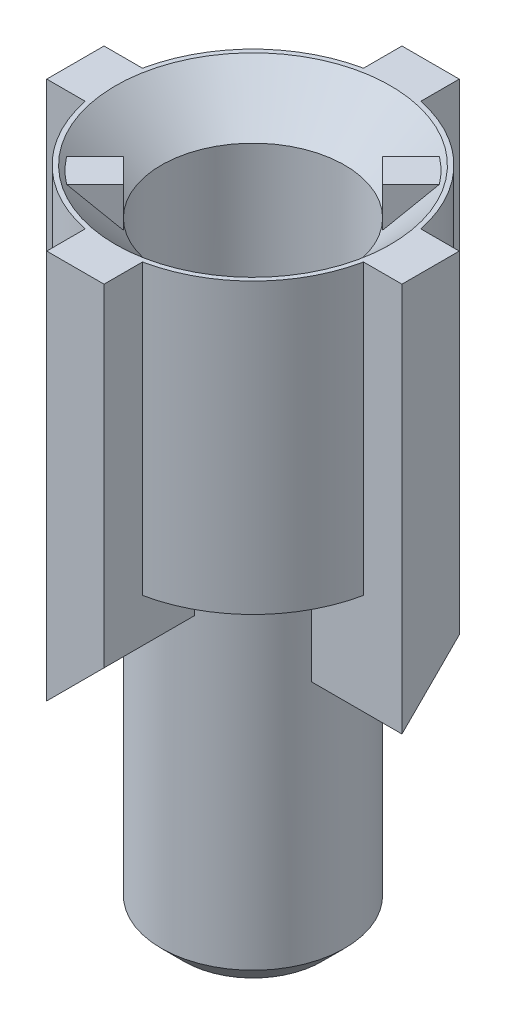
ISO-10303-21;
HEADER;
FILE_DESCRIPTION(('STEP AP214'),'2;1');
FILE_NAME('part.step','',(''),(''),'','','');
FILE_SCHEMA(('AUTOMOTIVE_DESIGN { 1 0 10303 214 1 1 1 1 }'));
ENDSEC;
DATA;
#1=APPLICATION_CONTEXT('core data for automotive mechanical design processes');
#2=APPLICATION_PROTOCOL_DEFINITION('international standard','automotive_design',2000,#1);
#3=PRODUCT_CONTEXT('',#1,'mechanical');
#4=PRODUCT('Part','Part','',(#3));
#5=PRODUCT_RELATED_PRODUCT_CATEGORY('part','',(#4));
#6=PRODUCT_DEFINITION_FORMATION('','',#4);
#7=PRODUCT_DEFINITION_CONTEXT('part definition',#1,'design');
#8=PRODUCT_DEFINITION('design','',#6,#7);
#9=PRODUCT_DEFINITION_SHAPE('','',#8);
#10=(LENGTH_UNIT() NAMED_UNIT(*) SI_UNIT(.MILLI.,.METRE.));
#11=(NAMED_UNIT(*) PLANE_ANGLE_UNIT() SI_UNIT($,.RADIAN.));
#12=(NAMED_UNIT(*) SI_UNIT($,.STERADIAN.) SOLID_ANGLE_UNIT());
#13=UNCERTAINTY_MEASURE_WITH_UNIT(LENGTH_MEASURE(1.E-05),#10,'distance_accuracy_value','');
#14=(GEOMETRIC_REPRESENTATION_CONTEXT(3) GLOBAL_UNCERTAINTY_ASSIGNED_CONTEXT((#13)) GLOBAL_UNIT_ASSIGNED_CONTEXT((#10,
#11,#12)) REPRESENTATION_CONTEXT('',''));
#15=CARTESIAN_POINT('',(0.,0.,0.));
#16=DIRECTION('',(0.,0.,1.));
#17=DIRECTION('',(1.,0.,0.));
#18=AXIS2_PLACEMENT_3D('',#15,#16,#17);
#19=CARTESIAN_POINT('',(0.,13.3,0.));
#20=DIRECTION('',(0.,1.,0.));
#21=DIRECTION('',(0.,0.,1.));
#22=AXIS2_PLACEMENT_3D('',#19,#20,#21);
#23=CONICAL_SURFACE('',#22,2.,0.78539816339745);
#24=CARTESIAN_POINT('',(0.,14.3,0.));
#25=DIRECTION('',(0.,1.,0.));
#26=DIRECTION('',(0.,0.,1.));
#27=AXIS2_PLACEMENT_3D('',#24,#25,#26);
#28=CIRCLE('',#27,3.);
#29=CARTESIAN_POINT('',(0.,14.3,3.));
#30=VERTEX_POINT('',#29);
#31=EDGE_CURVE('E335',#30,#30,#28,.F.);
#32=ORIENTED_EDGE('',*,*,#31,.F.);
#33=EDGE_LOOP('',(#32));
#34=FACE_BOUND('',#33,.T.);
#35=CARTESIAN_POINT('',(1.14884851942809,13.334904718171,-1.6795786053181));
#36=CARTESIAN_POINT('',(1.1841048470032,13.3256856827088,-1.64432227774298));
#37=CARTESIAN_POINT('',(1.219599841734,13.3182205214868,-1.60882728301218));
#38=CARTESIAN_POINT('',(1.29089390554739,13.306970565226,-1.5375332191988));
#39=CARTESIAN_POINT('',(1.32669309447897,13.3031872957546,-1.50173403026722));
#40=CARTESIAN_POINT('',(1.39791520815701,13.2995063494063,-1.43051191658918));
#41=CARTESIAN_POINT('',(1.43333679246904,13.2995575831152,-1.39509033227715));
#42=CARTESIAN_POINT('',(1.50406130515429,13.3034099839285,-1.32436581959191));
#43=CARTESIAN_POINT('',(1.53936428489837,13.3072092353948,-1.28906283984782));
#44=CARTESIAN_POINT('',(1.59208330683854,13.3156051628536,-1.23634381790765));
#45=CARTESIAN_POINT('',(1.60961243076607,13.3188520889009,-1.21881469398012));
#46=CARTESIAN_POINT('',(1.64463874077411,13.3262254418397,-1.18378838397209));
#47=CARTESIAN_POINT('',(1.66213561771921,13.3303548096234,-1.16629150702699));
#48=CARTESIAN_POINT('',(1.67957860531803,13.3349047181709,-1.14884851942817));
#49=B_SPLINE_CURVE_WITH_KNOTS('',3,(#35,#36,#37,#38,#39,#40,#41,#42,#43,#44,#45,#46,#47,#48),
.UNSPECIFIED.,.F.,.F.,(4,2,2,2,2,2,4),(0.,0.152104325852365,0.30427164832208,0.454411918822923,
0.604475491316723,0.679467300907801,0.75471304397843),.UNSPECIFIED.);
#50=CARTESIAN_POINT('',(1.14904851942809,13.3348525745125,-1.6793786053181));
#51=VERTEX_POINT('',#50);
#52=CARTESIAN_POINT('',(1.41421356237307,13.3,-1.41421356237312));
#53=VERTEX_POINT('',#52);
#54=EDGE_CURVE('E970',#51,#53,#49,.T.);
#55=ORIENTED_EDGE('',*,*,#54,.F.);
#56=CARTESIAN_POINT('',(1.76837067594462,14.2002,-2.29870076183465));
#57=CARTESIAN_POINT('',(1.71683620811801,14.1279324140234,-2.24716629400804));
#58=CARTESIAN_POINT('',(1.66528644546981,14.0556866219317,-2.19561653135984));
#59=CARTESIAN_POINT('',(1.56214565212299,13.9112541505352,-2.09247573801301));
#60=CARTESIAN_POINT('',(1.51055462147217,13.8390674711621,-2.04088470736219));
#61=CARTESIAN_POINT('',(1.40732046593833,13.6947685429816,-1.93765055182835));
#62=CARTESIAN_POINT('',(1.35567734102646,13.6226562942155,-1.88600742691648));
#63=CARTESIAN_POINT('',(1.25232048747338,13.4785329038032,-1.78265057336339));
#64=CARTESIAN_POINT('',(1.2006067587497,13.4065217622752,-1.73093684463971));
#65=CARTESIAN_POINT('',(1.14884851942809,13.3345745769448,-1.6791786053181));
#66=B_SPLINE_CURVE_WITH_KNOTS('',3,(#56,#57,#58,#59,#60,#61,#62,#63,#64,#65),.UNSPECIFIED.,.F.,
.F.,(4,2,2,2,4),(0.,0.307908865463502,0.615817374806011,0.923726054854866,1.23163509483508),.UNSPECIFIED.);
#67=CARTESIAN_POINT('',(1.76822805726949,14.2,-2.29855814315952));
#68=VERTEX_POINT('',#67);
#69=EDGE_CURVE('E262',#68,#51,#66,.T.);
#70=ORIENTED_EDGE('',*,*,#69,.F.);
#71=CARTESIAN_POINT('',(0.,14.2,0.));
#72=DIRECTION('',(0.,1.,0.));
#73=DIRECTION('',(0.,0.,1.));
#74=AXIS2_PLACEMENT_3D('',#71,#72,#73);
#75=CIRCLE('',#74,2.9);
#76=CARTESIAN_POINT('',(2.29855814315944,14.2,-1.7682280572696));
#77=VERTEX_POINT('',#76);
#78=EDGE_CURVE('E275',#68,#77,#75,.F.);
#79=ORIENTED_EDGE('',*,*,#78,.T.);
#80=CARTESIAN_POINT('',(1.67917860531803,13.3345745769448,-1.14884851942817));
#81=CARTESIAN_POINT('',(1.73093684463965,13.4065217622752,-1.20060675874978));
#82=CARTESIAN_POINT('',(1.78265057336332,13.4785329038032,-1.25232048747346));
#83=CARTESIAN_POINT('',(1.88600742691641,13.6226562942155,-1.35567734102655));
#84=CARTESIAN_POINT('',(1.93765055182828,13.6947685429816,-1.40732046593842));
#85=CARTESIAN_POINT('',(2.04088470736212,13.8390674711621,-1.51055462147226));
#86=CARTESIAN_POINT('',(2.09247573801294,13.9112541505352,-1.56214565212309));
#87=CARTESIAN_POINT('',(2.19561653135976,14.0556866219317,-1.66528644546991));
#88=CARTESIAN_POINT('',(2.24716629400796,14.1279324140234,-1.71683620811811));
#89=CARTESIAN_POINT('',(2.29870076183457,14.2002,-1.76837067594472));
#90=B_SPLINE_CURVE_WITH_KNOTS('',3,(#80,#81,#82,#83,#84,#85,#86,#87,#88,#89),.UNSPECIFIED.,.F.,
.F.,(4,2,2,2,4),(0.,0.307909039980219,0.615817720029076,0.923726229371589,1.23163509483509),.UNSPECIFIED.);
#91=CARTESIAN_POINT('',(1.67937860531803,13.3348525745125,-1.14904851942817));
#92=VERTEX_POINT('',#91);
#93=EDGE_CURVE('E278',#92,#77,#90,.T.);
#94=ORIENTED_EDGE('',*,*,#93,.F.);
#95=CARTESIAN_POINT('',(1.67957860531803,13.3349047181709,-1.14884851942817));
#96=CARTESIAN_POINT('',(1.64432227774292,13.3256856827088,-1.18410484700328));
#97=CARTESIAN_POINT('',(1.60882728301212,13.3182205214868,-1.21959984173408));
#98=CARTESIAN_POINT('',(1.53753321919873,13.306970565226,-1.29089390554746));
#99=CARTESIAN_POINT('',(1.50173403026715,13.3031872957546,-1.32669309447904));
#100=CARTESIAN_POINT('',(1.43051191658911,13.2995063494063,-1.39791520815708));
#101=CARTESIAN_POINT('',(1.39509033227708,13.2995575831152,-1.43333679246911));
#102=CARTESIAN_POINT('',(1.32436581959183,13.3034099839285,-1.50406130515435));
#103=CARTESIAN_POINT('',(1.28906283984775,13.3072092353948,-1.53936428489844));
#104=CARTESIAN_POINT('',(1.23634381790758,13.3156051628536,-1.59208330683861));
#105=CARTESIAN_POINT('',(1.21881469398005,13.3188520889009,-1.60961243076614));
#106=CARTESIAN_POINT('',(1.18378838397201,13.3262254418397,-1.64463874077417));
#107=CARTESIAN_POINT('',(1.16629150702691,13.3303548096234,-1.66213561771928));
#108=CARTESIAN_POINT('',(1.14884851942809,13.334904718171,-1.6795786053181));
#109=B_SPLINE_CURVE_WITH_KNOTS('',3,(#95,#96,#97,#98,#99,#100,#101,#102,#103,#104,#105,#106,
#107,#108),.UNSPECIFIED.,.F.,.F.,(4,2,2,2,2,2,4),(0.,0.152104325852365,0.304271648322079,
0.454411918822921,0.604475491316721,0.6794673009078,0.75471304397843),.UNSPECIFIED.);
#110=EDGE_CURVE('E12',#92,#53,#109,.T.);
#111=ORIENTED_EDGE('',*,*,#110,.T.);
#112=CARTESIAN_POINT('',(0.,13.3,0.));
#113=DIRECTION('',(0.,1.,0.));
#114=DIRECTION('',(0.,0.,1.));
#115=AXIS2_PLACEMENT_3D('',#112,#113,#114);
#116=CIRCLE('',#115,2.);
#117=CARTESIAN_POINT('',(-1.41421356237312,13.3,1.41421356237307));
#118=VERTEX_POINT('',#117);
#119=EDGE_CURVE('E338',#118,#53,#116,.T.);
#120=ORIENTED_EDGE('',*,*,#119,.F.);
#121=CARTESIAN_POINT('',(-1.14884851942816,13.3349047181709,1.67957860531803));
#122=CARTESIAN_POINT('',(-1.18410484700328,13.3256856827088,1.64432227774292));
#123=CARTESIAN_POINT('',(-1.21959984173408,13.3182205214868,1.60882728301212));
#124=CARTESIAN_POINT('',(-1.29089390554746,13.306970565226,1.53753321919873));
#125=CARTESIAN_POINT('',(-1.32669309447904,13.3031872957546,1.50173403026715));
#126=CARTESIAN_POINT('',(-1.39791520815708,13.2995063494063,1.43051191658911));
#127=CARTESIAN_POINT('',(-1.43333679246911,13.2995575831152,1.39509033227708));
#128=CARTESIAN_POINT('',(-1.50406130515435,13.3034099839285,1.32436581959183));
#129=CARTESIAN_POINT('',(-1.53936428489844,13.3072092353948,1.28906283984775));
#130=CARTESIAN_POINT('',(-1.59208330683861,13.3156051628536,1.23634381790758));
#131=CARTESIAN_POINT('',(-1.60961243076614,13.3188520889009,1.21881469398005));
#132=CARTESIAN_POINT('',(-1.64463874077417,13.3262254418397,1.18378838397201));
#133=CARTESIAN_POINT('',(-1.66213561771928,13.3303548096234,1.16629150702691));
#134=CARTESIAN_POINT('',(-1.6795786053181,13.334904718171,1.14884851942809));
#135=B_SPLINE_CURVE_WITH_KNOTS('',3,(#121,#122,#123,#124,#125,#126,#127,#128,#129,#130,#131,
#132,#133,#134),.UNSPECIFIED.,.F.,.F.,(4,2,2,2,2,2,4),(0.,0.152104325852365,0.304271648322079,
0.454411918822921,0.60447549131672,0.679467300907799,0.75471304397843),.UNSPECIFIED.);
#136=CARTESIAN_POINT('',(-1.14904851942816,13.3348525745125,1.67937860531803));
#137=VERTEX_POINT('',#136);
#138=EDGE_CURVE('E61',#137,#118,#135,.T.);
#139=ORIENTED_EDGE('',*,*,#138,.F.);
#140=CARTESIAN_POINT('',(-1.14884851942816,13.3345745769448,1.67917860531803));
#141=CARTESIAN_POINT('',(-1.20060675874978,13.4065217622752,1.73093684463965));
#142=CARTESIAN_POINT('',(-1.25232048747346,13.4785329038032,1.78265057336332));
#143=CARTESIAN_POINT('',(-1.35567734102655,13.6226562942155,1.88600742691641));
#144=CARTESIAN_POINT('',(-1.40732046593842,13.6947685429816,1.93765055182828));
#145=CARTESIAN_POINT('',(-1.51055462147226,13.8390674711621,2.04088470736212));
#146=CARTESIAN_POINT('',(-1.56214565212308,13.9112541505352,2.09247573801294));
#147=CARTESIAN_POINT('',(-1.66528644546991,14.0556866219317,2.19561653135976));
#148=CARTESIAN_POINT('',(-1.71683620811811,14.1279324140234,2.24716629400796));
#149=CARTESIAN_POINT('',(-1.76837067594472,14.2002,2.29870076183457));
#150=B_SPLINE_CURVE_WITH_KNOTS('',3,(#140,#141,#142,#143,#144,#145,#146,#147,#148,#149),
.UNSPECIFIED.,.F.,.F.,(4,2,2,2,4),(0.,0.30790903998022,0.615817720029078,0.92372622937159,
1.23163509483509),.UNSPECIFIED.);
#151=CARTESIAN_POINT('',(-1.76822805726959,14.2,2.29855814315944));
#152=VERTEX_POINT('',#151);
#153=EDGE_CURVE('E76',#137,#152,#150,.T.);
#154=ORIENTED_EDGE('',*,*,#153,.T.);
#155=CARTESIAN_POINT('',(0.,14.2,0.));
#156=DIRECTION('',(0.,1.,0.));
#157=DIRECTION('',(0.,0.,1.));
#158=AXIS2_PLACEMENT_3D('',#155,#156,#157);
#159=CIRCLE('',#158,2.9);
#160=CARTESIAN_POINT('',(-2.29855814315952,14.2,1.76822805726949));
#161=VERTEX_POINT('',#160);
#162=EDGE_CURVE('E319',#152,#161,#159,.F.);
#163=ORIENTED_EDGE('',*,*,#162,.T.);
#164=CARTESIAN_POINT('',(-2.29870076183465,14.2002,1.76837067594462));
#165=CARTESIAN_POINT('',(-2.24716629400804,14.1279324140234,1.71683620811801));
#166=CARTESIAN_POINT('',(-2.19561653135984,14.0556866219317,1.66528644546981));
#167=CARTESIAN_POINT('',(-2.09247573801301,13.9112541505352,1.56214565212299));
#168=CARTESIAN_POINT('',(-2.04088470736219,13.8390674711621,1.51055462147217));
#169=CARTESIAN_POINT('',(-1.93765055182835,13.6947685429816,1.40732046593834));
#170=CARTESIAN_POINT('',(-1.88600742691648,13.6226562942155,1.35567734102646));
#171=CARTESIAN_POINT('',(-1.78265057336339,13.4785329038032,1.25232048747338));
#172=CARTESIAN_POINT('',(-1.73093684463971,13.4065217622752,1.2006067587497));
#173=CARTESIAN_POINT('',(-1.6791786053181,13.3345745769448,1.14884851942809));
#174=B_SPLINE_CURVE_WITH_KNOTS('',3,(#164,#165,#166,#167,#168,#169,#170,#171,#172,#173),
.UNSPECIFIED.,.F.,.F.,(4,2,2,2,4),(0.,0.3079088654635,0.615817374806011,0.923726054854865,
1.23163509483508),.UNSPECIFIED.);
#175=CARTESIAN_POINT('',(-1.6793786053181,13.3348525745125,1.14904851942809));
#176=VERTEX_POINT('',#175);
#177=EDGE_CURVE('E314',#161,#176,#174,.T.);
#178=ORIENTED_EDGE('',*,*,#177,.T.);
#179=CARTESIAN_POINT('',(-1.6795786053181,13.334904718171,1.14884851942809));
#180=CARTESIAN_POINT('',(-1.64432227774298,13.3256856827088,1.1841048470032));
#181=CARTESIAN_POINT('',(-1.60882728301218,13.3182205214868,1.219599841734));
#182=CARTESIAN_POINT('',(-1.5375332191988,13.306970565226,1.29089390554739));
#183=CARTESIAN_POINT('',(-1.50173403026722,13.3031872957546,1.32669309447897));
#184=CARTESIAN_POINT('',(-1.43051191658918,13.2995063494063,1.39791520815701));
#185=CARTESIAN_POINT('',(-1.39509033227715,13.2995575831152,1.43333679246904));
#186=CARTESIAN_POINT('',(-1.32436581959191,13.3034099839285,1.50406130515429));
#187=CARTESIAN_POINT('',(-1.28906283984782,13.3072092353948,1.53936428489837));
#188=CARTESIAN_POINT('',(-1.23634381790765,13.3156051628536,1.59208330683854));
#189=CARTESIAN_POINT('',(-1.21881469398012,13.3188520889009,1.60961243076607));
#190=CARTESIAN_POINT('',(-1.18378838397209,13.3262254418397,1.64463874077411));
#191=CARTESIAN_POINT('',(-1.16629150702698,13.3303548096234,1.66213561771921));
#192=CARTESIAN_POINT('',(-1.14884851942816,13.3349047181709,1.67957860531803));
#193=B_SPLINE_CURVE_WITH_KNOTS('',3,(#179,#180,#181,#182,#183,#184,#185,#186,#187,#188,#189,
#190,#191,#192),.UNSPECIFIED.,.F.,.F.,(4,2,2,2,2,2,4),(0.,0.152104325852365,0.30427164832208,
0.454411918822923,0.604475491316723,0.679467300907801,0.75471304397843),.UNSPECIFIED.);
#194=EDGE_CURVE('E296',#176,#118,#193,.T.);
#195=ORIENTED_EDGE('',*,*,#194,.T.);
#196=EDGE_CURVE('E341',#53,#118,#116,.T.);
#197=ORIENTED_EDGE('',*,*,#196,.F.);
#198=EDGE_LOOP('',(#55,#70,#79,#94,#111,#120,#139,#154,#163,#178,#195,#197));
#199=FACE_BOUND('',#198,.T.);
#200=ADVANCED_FACE('F49',(#34,#199),#23,.F.);
#201=CARTESIAN_POINT('',(0.,8.4,0.));
#202=DIRECTION('',(0.,-1.,0.));
#203=DIRECTION('',(0.,0.,-1.));
#204=AXIS2_PLACEMENT_3D('',#201,#202,#203);
#205=CYLINDRICAL_SURFACE('',#204,2.);
#206=CARTESIAN_POINT('',(0.,0.500000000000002,0.));
#207=DIRECTION('',(0.,1.,0.));
#208=DIRECTION('',(0.,0.,1.));
#209=AXIS2_PLACEMENT_3D('',#206,#207,#208);
#210=CIRCLE('',#209,2.);
#211=CARTESIAN_POINT('',(0.,0.500000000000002,2.));
#212=VERTEX_POINT('',#211);
#213=EDGE_CURVE('E353',#212,#212,#210,.T.);
#214=ORIENTED_EDGE('',*,*,#213,.T.);
#215=EDGE_LOOP('',(#214));
#216=FACE_BOUND('',#215,.T.);
#217=DIRECTION('',(0.,-1.,0.));
#218=VECTOR('',#217,1.);
#219=CARTESIAN_POINT('',(-1.89983551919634,8.4,0.624999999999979));
#220=LINE('',#219,#218);
#221=CARTESIAN_POINT('',(-1.89983551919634,8.,0.624999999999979));
#222=VERTEX_POINT('',#221);
#223=CARTESIAN_POINT('',(-1.89983551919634,7.04999313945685,0.624999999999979));
#224=VERTEX_POINT('',#223);
#225=EDGE_CURVE('E515',#222,#224,#220,.T.);
#226=ORIENTED_EDGE('',*,*,#225,.T.);
#227=CARTESIAN_POINT('',(0.,6.42499313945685,0.));
#228=DIRECTION('',(0.,0.707106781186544,-0.707106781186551));
#229=DIRECTION('',(0.,-0.707106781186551,-0.707106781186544));
#230=AXIS2_PLACEMENT_3D('',#227,#228,#229);
#231=ELLIPSE('',#230,2.82842712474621,2.);
#232=CARTESIAN_POINT('',(-1.89983551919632,5.79999313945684,-0.625000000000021));
#233=VERTEX_POINT('',#232);
#234=EDGE_CURVE('E509',#224,#233,#231,.F.);
#235=ORIENTED_EDGE('',*,*,#234,.T.);
#236=DIRECTION('',(0.,-1.,0.));
#237=VECTOR('',#236,1.);
#238=CARTESIAN_POINT('',(-1.89983551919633,8.4,-0.62500000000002));
#239=LINE('',#238,#237);
#240=CARTESIAN_POINT('',(-1.89983551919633,8.,-0.62500000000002));
#241=VERTEX_POINT('',#240);
#242=EDGE_CURVE('E499',#233,#241,#239,.F.);
#243=ORIENTED_EDGE('',*,*,#242,.T.);
#244=CARTESIAN_POINT('',(0.,8.,0.));
#245=DIRECTION('',(0.,1.,0.));
#246=DIRECTION('',(0.,0.,1.));
#247=AXIS2_PLACEMENT_3D('',#244,#245,#246);
#248=CIRCLE('',#247,2.);
#249=CARTESIAN_POINT('',(-0.624999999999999,8.,-1.89983551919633));
#250=VERTEX_POINT('',#249);
#251=EDGE_CURVE('E345',#250,#241,#248,.T.);
#252=ORIENTED_EDGE('',*,*,#251,.F.);
#253=DIRECTION('',(0.,-1.,0.));
#254=VECTOR('',#253,1.);
#255=CARTESIAN_POINT('',(-0.624999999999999,8.4,-1.89983551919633));
#256=LINE('',#255,#254);
#257=CARTESIAN_POINT('',(-0.624999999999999,7.04999313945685,-1.89983551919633));
#258=VERTEX_POINT('',#257);
#259=EDGE_CURVE('E404',#250,#258,#256,.T.);
#260=ORIENTED_EDGE('',*,*,#259,.T.);
#261=CARTESIAN_POINT('',(0.,6.42499313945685,0.));
#262=DIRECTION('',(0.707106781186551,0.707106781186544,0.));
#263=DIRECTION('',(0.707106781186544,-0.707106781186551,0.));
#264=AXIS2_PLACEMENT_3D('',#261,#262,#263);
#265=ELLIPSE('',#264,2.8284271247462,2.);
#266=CARTESIAN_POINT('',(0.625000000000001,5.79999313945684,-1.89983551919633));
#267=VERTEX_POINT('',#266);
#268=EDGE_CURVE('E406',#258,#267,#265,.F.);
#269=ORIENTED_EDGE('',*,*,#268,.T.);
#270=DIRECTION('',(0.,-1.,0.));
#271=VECTOR('',#270,1.);
#272=CARTESIAN_POINT('',(0.625000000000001,8.4,-1.89983551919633));
#273=LINE('',#272,#271);
#274=CARTESIAN_POINT('',(0.625000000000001,8.,-1.89983551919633));
#275=VERTEX_POINT('',#274);
#276=EDGE_CURVE('E408',#267,#275,#273,.F.);
#277=ORIENTED_EDGE('',*,*,#276,.T.);
#278=CARTESIAN_POINT('',(1.89983551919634,8.,-0.624999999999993));
#279=VERTEX_POINT('',#278);
#280=EDGE_CURVE('E349',#279,#275,#248,.T.);
#281=ORIENTED_EDGE('',*,*,#280,.F.);
#282=DIRECTION('',(0.,-1.,0.));
#283=VECTOR('',#282,1.);
#284=CARTESIAN_POINT('',(1.89983551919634,8.4,-0.624999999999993));
#285=LINE('',#284,#283);
#286=CARTESIAN_POINT('',(1.89983551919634,7.04999313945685,-0.624999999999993));
#287=VERTEX_POINT('',#286);
#288=EDGE_CURVE('E443',#279,#287,#285,.T.);
#289=ORIENTED_EDGE('',*,*,#288,.T.);
#290=CARTESIAN_POINT('',(0.,6.42499313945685,0.));
#291=DIRECTION('',(0.,0.707106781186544,0.707106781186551));
#292=DIRECTION('',(0.,-0.707106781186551,0.707106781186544));
#293=AXIS2_PLACEMENT_3D('',#290,#291,#292);
#294=ELLIPSE('',#293,2.82842712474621,2.);
#295=CARTESIAN_POINT('',(1.89983551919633,5.79999313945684,0.625000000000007));
#296=VERTEX_POINT('',#295);
#297=EDGE_CURVE('E445',#287,#296,#294,.F.);
#298=ORIENTED_EDGE('',*,*,#297,.T.);
#299=DIRECTION('',(0.,-1.,0.));
#300=VECTOR('',#299,1.);
#301=CARTESIAN_POINT('',(1.89983551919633,8.4,0.625000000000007));
#302=LINE('',#301,#300);
#303=CARTESIAN_POINT('',(1.89983551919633,8.,0.625000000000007));
#304=VERTEX_POINT('',#303);
#305=EDGE_CURVE('E447',#296,#304,#302,.F.);
#306=ORIENTED_EDGE('',*,*,#305,.T.);
#307=CARTESIAN_POINT('',(0.624999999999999,8.,1.89983551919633));
#308=VERTEX_POINT('',#307);
#309=EDGE_CURVE('E658',#308,#304,#248,.T.);
#310=ORIENTED_EDGE('',*,*,#309,.F.);
#311=DIRECTION('',(0.,-1.,0.));
#312=VECTOR('',#311,1.);
#313=CARTESIAN_POINT('',(0.624999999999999,8.4,1.89983551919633));
#314=LINE('',#313,#312);
#315=CARTESIAN_POINT('',(0.624999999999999,7.04999313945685,1.89983551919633));
#316=VERTEX_POINT('',#315);
#317=EDGE_CURVE('E477',#308,#316,#314,.T.);
#318=ORIENTED_EDGE('',*,*,#317,.T.);
#319=CARTESIAN_POINT('',(0.,6.42499313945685,0.));
#320=DIRECTION('',(-0.707106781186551,0.707106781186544,0.));
#321=DIRECTION('',(-0.707106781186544,-0.707106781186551,0.));
#322=AXIS2_PLACEMENT_3D('',#319,#320,#321);
#323=ELLIPSE('',#322,2.82842712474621,2.);
#324=CARTESIAN_POINT('',(-0.625000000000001,5.79999313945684,1.89983551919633));
#325=VERTEX_POINT('',#324);
#326=EDGE_CURVE('E471',#316,#325,#323,.F.);
#327=ORIENTED_EDGE('',*,*,#326,.T.);
#328=DIRECTION('',(0.,-1.,0.));
#329=VECTOR('',#328,1.);
#330=CARTESIAN_POINT('',(-0.625000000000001,8.4,1.89983551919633));
#331=LINE('',#330,#329);
#332=CARTESIAN_POINT('',(-0.625000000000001,8.,1.89983551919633));
#333=VERTEX_POINT('',#332);
#334=EDGE_CURVE('E461',#325,#333,#331,.F.);
#335=ORIENTED_EDGE('',*,*,#334,.T.);
#336=EDGE_CURVE('E348',#222,#333,#248,.T.);
#337=ORIENTED_EDGE('',*,*,#336,.F.);
#338=EDGE_LOOP('',(#226,#235,#243,#252,#260,#269,#277,#281,#289,#298,#306,#310,#318,#327,#335,#337));
#339=FACE_BOUND('',#338,.T.);
#340=ADVANCED_FACE('F587',(#216,#339),#205,.T.);
#341=CARTESIAN_POINT('',(0.,8.,0.));
#342=DIRECTION('',(0.,1.,0.));
#343=DIRECTION('',(0.,0.,1.));
#344=AXIS2_PLACEMENT_3D('',#341,#342,#343);
#345=PLANE('',#344);
#346=DIRECTION('',(-1.,0.,0.));
#347=VECTOR('',#346,1.);
#348=CARTESIAN_POINT('',(0.,8.,0.624999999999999));
#349=LINE('',#348,#347);
#350=CARTESIAN_POINT('',(-3.03634237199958,8.,0.624999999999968));
#351=VERTEX_POINT('',#350);
#352=EDGE_CURVE('E480',#222,#351,#349,.T.);
#353=ORIENTED_EDGE('',*,*,#352,.F.);
#354=ORIENTED_EDGE('',*,*,#336,.T.);
#355=DIRECTION('',(0.,0.,-1.));
#356=VECTOR('',#355,1.);
#357=CARTESIAN_POINT('',(-0.625000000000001,8.,0.));
#358=LINE('',#357,#356);
#359=CARTESIAN_POINT('',(-0.625,8.,3.03634237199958));
#360=VERTEX_POINT('',#359);
#361=EDGE_CURVE('E455',#360,#333,#358,.T.);
#362=ORIENTED_EDGE('',*,*,#361,.F.);
#363=CARTESIAN_POINT('',(0.,8.,0.));
#364=DIRECTION('',(0.,1.,0.));
#365=DIRECTION('',(1.,0.,0.));
#366=AXIS2_PLACEMENT_3D('',#363,#364,#365);
#367=CIRCLE('',#366,3.1);
#368=EDGE_CURVE('E367',#351,#360,#367,.T.);
#369=ORIENTED_EDGE('',*,*,#368,.F.);
#370=EDGE_LOOP('',(#353,#354,#362,#369));
#371=FACE_BOUND('',#370,.T.);
#372=ADVANCED_FACE('F593',(#371),#345,.F.);
#373=DIRECTION('',(1.,0.,0.));
#374=VECTOR('',#373,1.);
#375=CARTESIAN_POINT('',(0.,8.,-0.625000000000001));
#376=LINE('',#375,#374);
#377=CARTESIAN_POINT('',(-3.03634237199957,8.,-0.625000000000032));
#378=VERTEX_POINT('',#377);
#379=EDGE_CURVE('E495',#378,#241,#376,.T.);
#380=ORIENTED_EDGE('',*,*,#379,.F.);
#381=CARTESIAN_POINT('',(-0.625,8.,-3.03634237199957));
#382=VERTEX_POINT('',#381);
#383=EDGE_CURVE('E363',#382,#378,#367,.T.);
#384=ORIENTED_EDGE('',*,*,#383,.F.);
#385=DIRECTION('',(0.,0.,-1.));
#386=VECTOR('',#385,1.);
#387=CARTESIAN_POINT('',(-0.624999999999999,8.,0.));
#388=LINE('',#387,#386);
#389=EDGE_CURVE('E378',#250,#382,#388,.T.);
#390=ORIENTED_EDGE('',*,*,#389,.F.);
#391=ORIENTED_EDGE('',*,*,#251,.T.);
#392=EDGE_LOOP('',(#380,#384,#390,#391));
#393=FACE_BOUND('',#392,.T.);
#394=ADVANCED_FACE('F611',(#393),#345,.F.);
#395=CARTESIAN_POINT('',(0.,14.3,0.));
#396=DIRECTION('',(0.,-1.,0.));
#397=DIRECTION('',(0.,0.,-1.));
#398=AXIS2_PLACEMENT_3D('',#395,#396,#397);
#399=CYLINDRICAL_SURFACE('',#398,3.1);
#400=DIRECTION('',(0.,-1.,0.));
#401=VECTOR('',#400,1.);
#402=CARTESIAN_POINT('',(-3.03634237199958,14.3,0.624999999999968));
#403=LINE('',#402,#401);
#404=CARTESIAN_POINT('',(-3.03634237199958,14.3,0.624999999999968));
#405=VERTEX_POINT('',#404);
#406=EDGE_CURVE('E492',#351,#405,#403,.F.);
#407=ORIENTED_EDGE('',*,*,#406,.F.);
#408=ORIENTED_EDGE('',*,*,#368,.T.);
#409=DIRECTION('',(0.,-1.,0.));
#410=VECTOR('',#409,1.);
#411=CARTESIAN_POINT('',(-0.625,14.3,3.03634237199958));
#412=LINE('',#411,#410);
#413=CARTESIAN_POINT('',(-0.625,14.3,3.03634237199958));
#414=VERTEX_POINT('',#413);
#415=EDGE_CURVE('E458',#414,#360,#412,.T.);
#416=ORIENTED_EDGE('',*,*,#415,.F.);
#417=CARTESIAN_POINT('',(0.,14.3,0.));
#418=DIRECTION('',(0.,1.,0.));
#419=DIRECTION('',(1.,0.,0.));
#420=AXIS2_PLACEMENT_3D('',#417,#418,#419);
#421=CIRCLE('',#420,3.1);
#422=EDGE_CURVE('E371',#405,#414,#421,.T.);
#423=ORIENTED_EDGE('',*,*,#422,.F.);
#424=EDGE_LOOP('',(#407,#408,#416,#423));
#425=FACE_BOUND('',#424,.T.);
#426=ADVANCED_FACE('F635',(#425),#399,.T.);
#427=DIRECTION('',(0.,-1.,0.));
#428=VECTOR('',#427,1.);
#429=CARTESIAN_POINT('',(-3.03634237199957,14.3,-0.625000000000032));
#430=LINE('',#429,#428);
#431=CARTESIAN_POINT('',(-3.03634237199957,14.3,-0.625000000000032));
#432=VERTEX_POINT('',#431);
#433=EDGE_CURVE('E497',#432,#378,#430,.T.);
#434=ORIENTED_EDGE('',*,*,#433,.F.);
#435=CARTESIAN_POINT('',(-0.625,14.3,-3.03634237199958));
#436=VERTEX_POINT('',#435);
#437=EDGE_CURVE('E362',#436,#432,#421,.T.);
#438=ORIENTED_EDGE('',*,*,#437,.F.);
#439=DIRECTION('',(0.,-1.,0.));
#440=VECTOR('',#439,1.);
#441=CARTESIAN_POINT('',(-0.625,14.3,-3.03634237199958));
#442=LINE('',#441,#440);
#443=EDGE_CURVE('E381',#382,#436,#442,.F.);
#444=ORIENTED_EDGE('',*,*,#443,.F.);
#445=ORIENTED_EDGE('',*,*,#383,.T.);
#446=EDGE_LOOP('',(#434,#438,#444,#445));
#447=FACE_BOUND('',#446,.T.);
#448=ADVANCED_FACE('F584',(#447),#399,.T.);
#449=DIRECTION('',(0.,0.,1.));
#450=VECTOR('',#449,1.);
#451=CARTESIAN_POINT('',(0.624999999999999,8.,0.));
#452=LINE('',#451,#450);
#453=CARTESIAN_POINT('',(0.625,8.,3.03634237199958));
#454=VERTEX_POINT('',#453);
#455=EDGE_CURVE('E450',#308,#454,#452,.T.);
#456=ORIENTED_EDGE('',*,*,#455,.F.);
#457=ORIENTED_EDGE('',*,*,#309,.T.);
#458=DIRECTION('',(-1.,0.,0.));
#459=VECTOR('',#458,1.);
#460=CARTESIAN_POINT('',(0.,8.,0.625000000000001));
#461=LINE('',#460,#459);
#462=CARTESIAN_POINT('',(3.03634237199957,8.,0.625000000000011));
#463=VERTEX_POINT('',#462);
#464=EDGE_CURVE('E411',#463,#304,#461,.T.);
#465=ORIENTED_EDGE('',*,*,#464,.F.);
#466=EDGE_CURVE('E684',#454,#463,#367,.T.);
#467=ORIENTED_EDGE('',*,*,#466,.F.);
#468=EDGE_LOOP('',(#456,#457,#465,#467));
#469=FACE_BOUND('',#468,.T.);
#470=ADVANCED_FACE('F701',(#469),#345,.F.);
#471=DIRECTION('',(0.,-1.,0.));
#472=VECTOR('',#471,1.);
#473=CARTESIAN_POINT('',(0.625,14.3,3.03634237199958));
#474=LINE('',#473,#472);
#475=CARTESIAN_POINT('',(0.625,14.3,3.03634237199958));
#476=VERTEX_POINT('',#475);
#477=EDGE_CURVE('E452',#454,#476,#474,.F.);
#478=ORIENTED_EDGE('',*,*,#477,.F.);
#479=ORIENTED_EDGE('',*,*,#466,.T.);
#480=DIRECTION('',(0.,-1.,0.));
#481=VECTOR('',#480,1.);
#482=CARTESIAN_POINT('',(3.03634237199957,14.3,0.625000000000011));
#483=LINE('',#482,#481);
#484=CARTESIAN_POINT('',(3.03634237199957,14.3,0.625000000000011));
#485=VERTEX_POINT('',#484);
#486=EDGE_CURVE('E414',#485,#463,#483,.T.);
#487=ORIENTED_EDGE('',*,*,#486,.F.);
#488=EDGE_CURVE('E636',#476,#485,#421,.T.);
#489=ORIENTED_EDGE('',*,*,#488,.F.);
#490=EDGE_LOOP('',(#478,#479,#487,#489));
#491=FACE_BOUND('',#490,.T.);
#492=ADVANCED_FACE('F583',(#491),#399,.T.);
#493=DIRECTION('',(1.,0.,0.));
#494=VECTOR('',#493,1.);
#495=CARTESIAN_POINT('',(0.,8.,-0.624999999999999));
#496=LINE('',#495,#494);
#497=CARTESIAN_POINT('',(3.03634237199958,8.,-0.624999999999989));
#498=VERTEX_POINT('',#497);
#499=EDGE_CURVE('E417',#279,#498,#496,.T.);
#500=ORIENTED_EDGE('',*,*,#499,.F.);
#501=ORIENTED_EDGE('',*,*,#280,.T.);
#502=DIRECTION('',(0.,0.,1.));
#503=VECTOR('',#502,1.);
#504=CARTESIAN_POINT('',(0.625000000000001,8.,0.));
#505=LINE('',#504,#503);
#506=CARTESIAN_POINT('',(0.625,8.,-3.03634237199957));
#507=VERTEX_POINT('',#506);
#508=EDGE_CURVE('E372',#507,#275,#505,.T.);
#509=ORIENTED_EDGE('',*,*,#508,.F.);
#510=EDGE_CURVE('E368',#498,#507,#367,.T.);
#511=ORIENTED_EDGE('',*,*,#510,.F.);
#512=EDGE_LOOP('',(#500,#501,#509,#511));
#513=FACE_BOUND('',#512,.T.);
#514=ADVANCED_FACE('F580',(#513),#345,.F.);
#515=DIRECTION('',(0.,-1.,0.));
#516=VECTOR('',#515,1.);
#517=CARTESIAN_POINT('',(3.03634237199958,14.3,-0.624999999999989));
#518=LINE('',#517,#516);
#519=CARTESIAN_POINT('',(3.03634237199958,14.3,-0.624999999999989));
#520=VERTEX_POINT('',#519);
#521=EDGE_CURVE('E420',#498,#520,#518,.F.);
#522=ORIENTED_EDGE('',*,*,#521,.F.);
#523=ORIENTED_EDGE('',*,*,#510,.T.);
#524=DIRECTION('',(0.,-1.,0.));
#525=VECTOR('',#524,1.);
#526=CARTESIAN_POINT('',(0.625,14.3,-3.03634237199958));
#527=LINE('',#526,#525);
#528=CARTESIAN_POINT('',(0.625,14.3,-3.03634237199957));
#529=VERTEX_POINT('',#528);
#530=EDGE_CURVE('E375',#529,#507,#527,.T.);
#531=ORIENTED_EDGE('',*,*,#530,.F.);
#532=EDGE_CURVE('E366',#520,#529,#421,.T.);
#533=ORIENTED_EDGE('',*,*,#532,.F.);
#534=EDGE_LOOP('',(#522,#523,#531,#533));
#535=FACE_BOUND('',#534,.T.);
#536=ADVANCED_FACE('F573',(#535),#399,.T.);
#537=CARTESIAN_POINT('',(0.,0.,0.));
#538=DIRECTION('',(0.,1.,0.));
#539=DIRECTION('',(0.,0.,1.));
#540=AXIS2_PLACEMENT_3D('',#537,#538,#539);
#541=PLANE('',#540);
#542=CARTESIAN_POINT('',(0.,0.,0.));
#543=DIRECTION('',(0.,1.,0.));
#544=DIRECTION('',(0.,0.,1.));
#545=AXIS2_PLACEMENT_3D('',#542,#543,#544);
#546=CIRCLE('',#545,1.5);
#547=CARTESIAN_POINT('',(0.,0.,1.5));
#548=VERTEX_POINT('',#547);
#549=EDGE_CURVE('E350',#548,#548,#546,.F.);
#550=ORIENTED_EDGE('',*,*,#549,.T.);
#551=EDGE_LOOP('',(#550));
#552=FACE_BOUND('',#551,.T.);
#553=CARTESIAN_POINT('',(0.,0.,0.));
#554=DIRECTION('',(0.,1.,0.));
#555=DIRECTION('',(0.,0.,1.));
#556=AXIS2_PLACEMENT_3D('',#553,#554,#555);
#557=CIRCLE('',#556,0.9);
#558=CARTESIAN_POINT('',(0.,0.,0.9));
#559=VERTEX_POINT('',#558);
#560=EDGE_CURVE('E356',#559,#559,#557,.T.);
#561=ORIENTED_EDGE('',*,*,#560,.T.);
#562=EDGE_LOOP('',(#561));
#563=FACE_BOUND('',#562,.T.);
#564=ADVANCED_FACE('F568',(#552,#563),#541,.F.);
#565=CARTESIAN_POINT('',(0.,8.4,0.));
#566=DIRECTION('',(0.,-1.,0.));
#567=DIRECTION('',(0.,0.,-1.));
#568=AXIS2_PLACEMENT_3D('',#565,#566,#567);
#569=CYLINDRICAL_SURFACE('',#568,0.9);
#570=CARTESIAN_POINT('',(0.,7.3,0.));
#571=DIRECTION('',(0.,1.,0.));
#572=DIRECTION('',(0.,0.,1.));
#573=AXIS2_PLACEMENT_3D('',#570,#571,#572);
#574=CIRCLE('',#573,0.9);
#575=CARTESIAN_POINT('',(0.,7.3,0.9));
#576=VERTEX_POINT('',#575);
#577=EDGE_CURVE('E342',#576,#576,#574,.T.);
#578=ORIENTED_EDGE('',*,*,#577,.T.);
#579=EDGE_LOOP('',(#578));
#580=FACE_BOUND('',#579,.T.);
#581=ORIENTED_EDGE('',*,*,#560,.F.);
#582=EDGE_LOOP('',(#581));
#583=FACE_BOUND('',#582,.T.);
#584=ADVANCED_FACE('F564',(#580,#583),#569,.F.);
#585=CARTESIAN_POINT('',(0.,0.500000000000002,0.));
#586=DIRECTION('',(0.,1.,0.));
#587=DIRECTION('',(0.,0.,1.));
#588=AXIS2_PLACEMENT_3D('',#585,#586,#587);
#589=CONICAL_SURFACE('',#588,2.,0.78539816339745);
#590=ORIENTED_EDGE('',*,*,#549,.F.);
#591=EDGE_LOOP('',(#590));
#592=FACE_BOUND('',#591,.T.);
#593=ORIENTED_EDGE('',*,*,#213,.F.);
#594=EDGE_LOOP('',(#593));
#595=FACE_BOUND('',#594,.T.);
#596=ADVANCED_FACE('F567',(#592,#595),#589,.T.);
#597=CARTESIAN_POINT('',(0.,14.3,0.));
#598=DIRECTION('',(0.,1.,0.));
#599=DIRECTION('',(0.,0.,1.));
#600=AXIS2_PLACEMENT_3D('',#597,#598,#599);
#601=PLANE('',#600);
#602=ORIENTED_EDGE('',*,*,#31,.T.);
#603=EDGE_LOOP('',(#602));
#604=FACE_BOUND('',#603,.T.);
#605=ORIENTED_EDGE('',*,*,#437,.T.);
#606=DIRECTION('',(-1.,0.,0.));
#607=VECTOR('',#606,1.);
#608=CARTESIAN_POINT('',(3.10100000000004,14.3,-0.624999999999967));
#609=LINE('',#608,#607);
#610=CARTESIAN_POINT('',(-3.87499999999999,14.3,-0.625000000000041));
#611=VERTEX_POINT('',#610);
#612=EDGE_CURVE('E500',#432,#611,#609,.T.);
#613=ORIENTED_EDGE('',*,*,#612,.T.);
#614=DIRECTION('',(0.,0.,1.));
#615=VECTOR('',#614,1.);
#616=CARTESIAN_POINT('',(-3.87500000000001,14.3,0.624999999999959));
#617=LINE('',#616,#615);
#618=CARTESIAN_POINT('',(-3.87500000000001,14.3,0.624999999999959));
#619=VERTEX_POINT('',#618);
#620=EDGE_CURVE('E502',#611,#619,#617,.T.);
#621=ORIENTED_EDGE('',*,*,#620,.T.);
#622=DIRECTION('',(-1.,0.,0.));
#623=VECTOR('',#622,1.);
#624=CARTESIAN_POINT('',(3.10100000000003,14.3,0.625000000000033));
#625=LINE('',#624,#623);
#626=EDGE_CURVE('E516',#405,#619,#625,.T.);
#627=ORIENTED_EDGE('',*,*,#626,.F.);
#628=ORIENTED_EDGE('',*,*,#422,.T.);
#629=DIRECTION('',(0.,0.,1.));
#630=VECTOR('',#629,1.);
#631=CARTESIAN_POINT('',(-0.625,14.3,-3.876));
#632=LINE('',#631,#630);
#633=CARTESIAN_POINT('',(-0.625,14.3,3.875));
#634=VERTEX_POINT('',#633);
#635=EDGE_CURVE('E462',#414,#634,#632,.T.);
#636=ORIENTED_EDGE('',*,*,#635,.T.);
#637=DIRECTION('',(1.,0.,0.));
#638=VECTOR('',#637,1.);
#639=CARTESIAN_POINT('',(0.625,14.3,3.875));
#640=LINE('',#639,#638);
#641=CARTESIAN_POINT('',(0.625,14.3,3.875));
#642=VERTEX_POINT('',#641);
#643=EDGE_CURVE('E464',#634,#642,#640,.T.);
#644=ORIENTED_EDGE('',*,*,#643,.T.);
#645=DIRECTION('',(0.,0.,1.));
#646=VECTOR('',#645,1.);
#647=CARTESIAN_POINT('',(0.625,14.3,-3.876));
#648=LINE('',#647,#646);
#649=EDGE_CURVE('E478',#476,#642,#648,.T.);
#650=ORIENTED_EDGE('',*,*,#649,.F.);
#651=ORIENTED_EDGE('',*,*,#488,.T.);
#652=DIRECTION('',(1.,0.,0.));
#653=VECTOR('',#652,1.);
#654=CARTESIAN_POINT('',(-3.10100000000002,14.3,0.624999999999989));
#655=LINE('',#654,#653);
#656=CARTESIAN_POINT('',(3.875,14.3,0.625000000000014));
#657=VERTEX_POINT('',#656);
#658=EDGE_CURVE('E427',#485,#657,#655,.T.);
#659=ORIENTED_EDGE('',*,*,#658,.T.);
#660=DIRECTION('',(0.,0.,-1.));
#661=VECTOR('',#660,1.);
#662=CARTESIAN_POINT('',(3.875,14.3,-0.624999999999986));
#663=LINE('',#662,#661);
#664=CARTESIAN_POINT('',(3.875,14.3,-0.624999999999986));
#665=VERTEX_POINT('',#664);
#666=EDGE_CURVE('E431',#657,#665,#663,.T.);
#667=ORIENTED_EDGE('',*,*,#666,.T.);
#668=DIRECTION('',(1.,0.,0.));
#669=VECTOR('',#668,1.);
#670=CARTESIAN_POINT('',(-3.10100000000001,14.3,-0.625000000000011));
#671=LINE('',#670,#669);
#672=EDGE_CURVE('E429',#520,#665,#671,.T.);
#673=ORIENTED_EDGE('',*,*,#672,.F.);
#674=ORIENTED_EDGE('',*,*,#532,.T.);
#675=DIRECTION('',(0.,0.,-1.));
#676=VECTOR('',#675,1.);
#677=CARTESIAN_POINT('',(0.625,14.3,3.101));
#678=LINE('',#677,#676);
#679=CARTESIAN_POINT('',(0.625,14.3,-3.875));
#680=VERTEX_POINT('',#679);
#681=EDGE_CURVE('E388',#529,#680,#678,.T.);
#682=ORIENTED_EDGE('',*,*,#681,.T.);
#683=DIRECTION('',(-1.,0.,0.));
#684=VECTOR('',#683,1.);
#685=CARTESIAN_POINT('',(-0.625,14.3,-3.875));
#686=LINE('',#685,#684);
#687=CARTESIAN_POINT('',(-0.625,14.3,-3.875));
#688=VERTEX_POINT('',#687);
#689=EDGE_CURVE('E392',#680,#688,#686,.T.);
#690=ORIENTED_EDGE('',*,*,#689,.T.);
#691=DIRECTION('',(0.,0.,-1.));
#692=VECTOR('',#691,1.);
#693=CARTESIAN_POINT('',(-0.625,14.3,3.101));
#694=LINE('',#693,#692);
#695=EDGE_CURVE('E390',#436,#688,#694,.T.);
#696=ORIENTED_EDGE('',*,*,#695,.F.);
#697=EDGE_LOOP('',(#605,#613,#621,#627,#628,#636,#644,#650,#651,#659,#667,#673,#674,#682,#690,#696));
#698=FACE_BOUND('',#697,.T.);
#699=ADVANCED_FACE('F555',(#604,#698),#601,.T.);
#700=CARTESIAN_POINT('',(0.,14.3,0.));
#701=DIRECTION('',(0.,-1.,0.));
#702=DIRECTION('',(0.,0.,-1.));
#703=AXIS2_PLACEMENT_3D('',#700,#701,#702);
#704=CYLINDRICAL_SURFACE('',#703,2.);
#705=ORIENTED_EDGE('',*,*,#119,.T.);
#706=ORIENTED_EDGE('',*,*,#196,.T.);
#707=EDGE_LOOP('',(#705,#706));
#708=FACE_BOUND('',#707,.T.);
#709=CARTESIAN_POINT('',(0.,8.4,0.));
#710=DIRECTION('',(0.,1.,0.));
#711=DIRECTION('',(0.,0.,1.));
#712=AXIS2_PLACEMENT_3D('',#709,#710,#711);
#713=CIRCLE('',#712,2.);
#714=CARTESIAN_POINT('',(0.,8.4,2.));
#715=VERTEX_POINT('',#714);
#716=EDGE_CURVE('E359',#715,#715,#713,.F.);
#717=ORIENTED_EDGE('',*,*,#716,.T.);
#718=EDGE_LOOP('',(#717));
#719=FACE_BOUND('',#718,.T.);
#720=ADVANCED_FACE('F551',(#708,#719),#704,.F.);
#721=CARTESIAN_POINT('',(0.,7.3,0.));
#722=DIRECTION('',(0.,1.,0.));
#723=DIRECTION('',(0.,0.,1.));
#724=AXIS2_PLACEMENT_3D('',#721,#722,#723);
#725=CONICAL_SURFACE('',#724,0.9,0.78539816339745);
#726=ORIENTED_EDGE('',*,*,#716,.F.);
#727=EDGE_LOOP('',(#726));
#728=FACE_BOUND('',#727,.T.);
#729=ORIENTED_EDGE('',*,*,#577,.F.);
#730=EDGE_LOOP('',(#729));
#731=FACE_BOUND('',#730,.T.);
#732=ADVANCED_FACE('F554',(#728,#731),#725,.F.);
#733=CARTESIAN_POINT('',(0.625,14.3,3.101));
#734=DIRECTION('',(-1.,0.,0.));
#735=DIRECTION('',(0.,-1.,0.));
#736=AXIS2_PLACEMENT_3D('',#733,#734,#735);
#737=PLANE('',#736);
#738=ORIENTED_EDGE('',*,*,#530,.T.);
#739=ORIENTED_EDGE('',*,*,#508,.T.);
#740=ORIENTED_EDGE('',*,*,#276,.F.);
#741=DIRECTION('',(0.,0.,-1.));
#742=VECTOR('',#741,1.);
#743=CARTESIAN_POINT('',(0.625000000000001,5.79999313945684,3.101));
#744=LINE('',#743,#742);
#745=CARTESIAN_POINT('',(0.625000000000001,5.79999313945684,-3.875));
#746=VERTEX_POINT('',#745);
#747=EDGE_CURVE('E386',#267,#746,#744,.T.);
#748=ORIENTED_EDGE('',*,*,#747,.T.);
#749=DIRECTION('',(0.,1.,0.));
#750=VECTOR('',#749,1.);
#751=CARTESIAN_POINT('',(0.625,14.3,-3.875));
#752=LINE('',#751,#750);
#753=EDGE_CURVE('E395',#746,#680,#752,.T.);
#754=ORIENTED_EDGE('',*,*,#753,.T.);
#755=ORIENTED_EDGE('',*,*,#681,.F.);
#756=EDGE_LOOP('',(#738,#739,#740,#748,#754,#755));
#757=FACE_BOUND('',#756,.T.);
#758=ADVANCED_FACE('F561',(#757),#737,.F.);
#759=CARTESIAN_POINT('',(-0.625,14.3,3.101));
#760=DIRECTION('',(1.,0.,0.));
#761=DIRECTION('',(0.,1.,0.));
#762=AXIS2_PLACEMENT_3D('',#759,#760,#761);
#763=PLANE('',#762);
#764=ORIENTED_EDGE('',*,*,#259,.F.);
#765=ORIENTED_EDGE('',*,*,#389,.T.);
#766=ORIENTED_EDGE('',*,*,#443,.T.);
#767=ORIENTED_EDGE('',*,*,#695,.T.);
#768=DIRECTION('',(0.,-1.,0.));
#769=VECTOR('',#768,1.);
#770=CARTESIAN_POINT('',(-0.625,14.3,-3.875));
#771=LINE('',#770,#769);
#772=CARTESIAN_POINT('',(-0.624999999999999,7.04999313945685,-3.875));
#773=VERTEX_POINT('',#772);
#774=EDGE_CURVE('E401',#688,#773,#771,.T.);
#775=ORIENTED_EDGE('',*,*,#774,.T.);
#776=DIRECTION('',(0.,0.,-1.));
#777=VECTOR('',#776,1.);
#778=CARTESIAN_POINT('',(-0.624999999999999,7.04999313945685,3.101));
#779=LINE('',#778,#777);
#780=EDGE_CURVE('E384',#258,#773,#779,.T.);
#781=ORIENTED_EDGE('',*,*,#780,.F.);
#782=EDGE_LOOP('',(#764,#765,#766,#767,#775,#781));
#783=FACE_BOUND('',#782,.T.);
#784=ADVANCED_FACE('F606',(#783),#763,.F.);
#785=CARTESIAN_POINT('',(0.,0.,-3.875));
#786=DIRECTION('',(0.,0.,1.));
#787=DIRECTION('',(1.,0.,0.));
#788=AXIS2_PLACEMENT_3D('',#785,#786,#787);
#789=PLANE('',#788);
#790=ORIENTED_EDGE('',*,*,#774,.F.);
#791=ORIENTED_EDGE('',*,*,#689,.F.);
#792=ORIENTED_EDGE('',*,*,#753,.F.);
#793=DIRECTION('',(0.707106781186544,-0.707106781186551,0.));
#794=VECTOR('',#793,1.);
#795=CARTESIAN_POINT('',(0.625000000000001,5.79999313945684,-3.875));
#796=LINE('',#795,#794);
#797=EDGE_CURVE('E398',#773,#746,#796,.T.);
#798=ORIENTED_EDGE('',*,*,#797,.F.);
#799=EDGE_LOOP('',(#790,#791,#792,#798));
#800=FACE_BOUND('',#799,.T.);
#801=ADVANCED_FACE('F652',(#800),#789,.F.);
#802=CARTESIAN_POINT('',(0.625000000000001,5.79999313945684,3.101));
#803=DIRECTION('',(0.707106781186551,0.707106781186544,0.));
#804=DIRECTION('',(-0.707106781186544,0.707106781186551,0.));
#805=AXIS2_PLACEMENT_3D('',#802,#803,#804);
#806=PLANE('',#805);
#807=ORIENTED_EDGE('',*,*,#268,.F.);
#808=ORIENTED_EDGE('',*,*,#780,.T.);
#809=ORIENTED_EDGE('',*,*,#797,.T.);
#810=ORIENTED_EDGE('',*,*,#747,.F.);
#811=EDGE_LOOP('',(#807,#808,#809,#810));
#812=FACE_BOUND('',#811,.T.);
#813=ADVANCED_FACE('F654',(#812),#806,.F.);
#814=CARTESIAN_POINT('',(-3.10100000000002,14.3,0.624999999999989));
#815=DIRECTION('',(0.,0.,-1.));
#816=DIRECTION('',(-1.,0.,0.));
#817=AXIS2_PLACEMENT_3D('',#814,#815,#816);
#818=PLANE('',#817);
#819=ORIENTED_EDGE('',*,*,#486,.T.);
#820=ORIENTED_EDGE('',*,*,#464,.T.);
#821=ORIENTED_EDGE('',*,*,#305,.F.);
#822=DIRECTION('',(1.,0.,0.));
#823=VECTOR('',#822,1.);
#824=CARTESIAN_POINT('',(-3.10100000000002,5.79999313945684,0.62499999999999));
#825=LINE('',#824,#823);
#826=CARTESIAN_POINT('',(3.875,5.79999313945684,0.625000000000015));
#827=VERTEX_POINT('',#826);
#828=EDGE_CURVE('E425',#296,#827,#825,.T.);
#829=ORIENTED_EDGE('',*,*,#828,.T.);
#830=DIRECTION('',(0.,1.,0.));
#831=VECTOR('',#830,1.);
#832=CARTESIAN_POINT('',(3.875,14.3,0.625000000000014));
#833=LINE('',#832,#831);
#834=EDGE_CURVE('E434',#827,#657,#833,.T.);
#835=ORIENTED_EDGE('',*,*,#834,.T.);
#836=ORIENTED_EDGE('',*,*,#658,.F.);
#837=EDGE_LOOP('',(#819,#820,#821,#829,#835,#836));
#838=FACE_BOUND('',#837,.T.);
#839=ADVANCED_FACE('F686',(#838),#818,.F.);
#840=CARTESIAN_POINT('',(-3.10100000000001,14.3,-0.625000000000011));
#841=DIRECTION('',(0.,0.,1.));
#842=DIRECTION('',(1.,0.,0.));
#843=AXIS2_PLACEMENT_3D('',#840,#841,#842);
#844=PLANE('',#843);
#845=ORIENTED_EDGE('',*,*,#288,.F.);
#846=ORIENTED_EDGE('',*,*,#499,.T.);
#847=ORIENTED_EDGE('',*,*,#521,.T.);
#848=ORIENTED_EDGE('',*,*,#672,.T.);
#849=DIRECTION('',(0.,-1.,0.));
#850=VECTOR('',#849,1.);
#851=CARTESIAN_POINT('',(3.875,14.3,-0.624999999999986));
#852=LINE('',#851,#850);
#853=CARTESIAN_POINT('',(3.875,7.04999313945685,-0.624999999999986));
#854=VERTEX_POINT('',#853);
#855=EDGE_CURVE('E440',#665,#854,#852,.T.);
#856=ORIENTED_EDGE('',*,*,#855,.T.);
#857=DIRECTION('',(1.,0.,0.));
#858=VECTOR('',#857,1.);
#859=CARTESIAN_POINT('',(-3.10100000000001,7.04999313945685,-0.62500000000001));
#860=LINE('',#859,#858);
#861=EDGE_CURVE('E423',#287,#854,#860,.T.);
#862=ORIENTED_EDGE('',*,*,#861,.F.);
#863=EDGE_LOOP('',(#845,#846,#847,#848,#856,#862));
#864=FACE_BOUND('',#863,.T.);
#865=ADVANCED_FACE('F695',(#864),#844,.F.);
#866=CARTESIAN_POINT('',(3.875,0.,0.));
#867=DIRECTION('',(-1.,0.,0.));
#868=DIRECTION('',(0.,0.,1.));
#869=AXIS2_PLACEMENT_3D('',#866,#867,#868);
#870=PLANE('',#869);
#871=ORIENTED_EDGE('',*,*,#855,.F.);
#872=ORIENTED_EDGE('',*,*,#666,.F.);
#873=ORIENTED_EDGE('',*,*,#834,.F.);
#874=DIRECTION('',(0.,-0.707106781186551,0.707106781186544));
#875=VECTOR('',#874,1.);
#876=CARTESIAN_POINT('',(3.875,5.79999313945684,0.625000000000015));
#877=LINE('',#876,#875);
#878=EDGE_CURVE('E437',#854,#827,#877,.T.);
#879=ORIENTED_EDGE('',*,*,#878,.F.);
#880=EDGE_LOOP('',(#871,#872,#873,#879));
#881=FACE_BOUND('',#880,.T.);
#882=ADVANCED_FACE('F692',(#881),#870,.F.);
#883=CARTESIAN_POINT('',(-3.10100000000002,5.79999313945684,0.62499999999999));
#884=DIRECTION('',(0.,0.707106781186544,0.707106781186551));
#885=DIRECTION('',(0.,-0.707106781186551,0.707106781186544));
#886=AXIS2_PLACEMENT_3D('',#883,#884,#885);
#887=PLANE('',#886);
#888=ORIENTED_EDGE('',*,*,#297,.F.);
#889=ORIENTED_EDGE('',*,*,#861,.T.);
#890=ORIENTED_EDGE('',*,*,#878,.T.);
#891=ORIENTED_EDGE('',*,*,#828,.F.);
#892=EDGE_LOOP('',(#888,#889,#890,#891));
#893=FACE_BOUND('',#892,.T.);
#894=ADVANCED_FACE('F700',(#893),#887,.F.);
#895=CARTESIAN_POINT('',(0.625,14.3,-3.876));
#896=DIRECTION('',(-1.,0.,0.));
#897=DIRECTION('',(0.,-1.,0.));
#898=AXIS2_PLACEMENT_3D('',#895,#896,#897);
#899=PLANE('',#898);
#900=ORIENTED_EDGE('',*,*,#317,.F.);
#901=ORIENTED_EDGE('',*,*,#455,.T.);
#902=ORIENTED_EDGE('',*,*,#477,.T.);
#903=ORIENTED_EDGE('',*,*,#649,.T.);
#904=DIRECTION('',(0.,-1.,0.));
#905=VECTOR('',#904,1.);
#906=CARTESIAN_POINT('',(0.625,14.3,3.875));
#907=LINE('',#906,#905);
#908=CARTESIAN_POINT('',(0.624999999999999,7.04999313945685,3.875));
#909=VERTEX_POINT('',#908);
#910=EDGE_CURVE('E474',#642,#909,#907,.T.);
#911=ORIENTED_EDGE('',*,*,#910,.T.);
#912=DIRECTION('',(0.,0.,1.));
#913=VECTOR('',#912,1.);
#914=CARTESIAN_POINT('',(0.624999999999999,7.04999313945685,-3.876));
#915=LINE('',#914,#913);
#916=EDGE_CURVE('E472',#316,#909,#915,.T.);
#917=ORIENTED_EDGE('',*,*,#916,.F.);
#918=EDGE_LOOP('',(#900,#901,#902,#903,#911,#917));
#919=FACE_BOUND('',#918,.T.);
#920=ADVANCED_FACE('F674',(#919),#899,.F.);
#921=CARTESIAN_POINT('',(-0.625,14.3,-3.876));
#922=DIRECTION('',(1.,0.,0.));
#923=DIRECTION('',(0.,1.,0.));
#924=AXIS2_PLACEMENT_3D('',#921,#922,#923);
#925=PLANE('',#924);
#926=ORIENTED_EDGE('',*,*,#415,.T.);
#927=ORIENTED_EDGE('',*,*,#361,.T.);
#928=ORIENTED_EDGE('',*,*,#334,.F.);
#929=DIRECTION('',(0.,0.,1.));
#930=VECTOR('',#929,1.);
#931=CARTESIAN_POINT('',(-0.625000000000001,5.79999313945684,-3.876));
#932=LINE('',#931,#930);
#933=CARTESIAN_POINT('',(-0.625000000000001,5.79999313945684,3.875));
#934=VERTEX_POINT('',#933);
#935=EDGE_CURVE('E466',#325,#934,#932,.T.);
#936=ORIENTED_EDGE('',*,*,#935,.T.);
#937=DIRECTION('',(0.,1.,0.));
#938=VECTOR('',#937,1.);
#939=CARTESIAN_POINT('',(-0.625,14.3,3.875));
#940=LINE('',#939,#938);
#941=EDGE_CURVE('E465',#934,#634,#940,.T.);
#942=ORIENTED_EDGE('',*,*,#941,.T.);
#943=ORIENTED_EDGE('',*,*,#635,.F.);
#944=EDGE_LOOP('',(#926,#927,#928,#936,#942,#943));
#945=FACE_BOUND('',#944,.T.);
#946=ADVANCED_FACE('F667',(#945),#925,.F.);
#947=CARTESIAN_POINT('',(-0.625000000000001,5.79999313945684,-3.876));
#948=DIRECTION('',(-0.707106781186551,0.707106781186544,0.));
#949=DIRECTION('',(-0.707106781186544,-0.707106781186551,0.));
#950=AXIS2_PLACEMENT_3D('',#947,#948,#949);
#951=PLANE('',#950);
#952=ORIENTED_EDGE('',*,*,#326,.F.);
#953=ORIENTED_EDGE('',*,*,#916,.T.);
#954=DIRECTION('',(-0.707106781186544,-0.707106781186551,0.));
#955=VECTOR('',#954,1.);
#956=CARTESIAN_POINT('',(-0.625000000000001,5.79999313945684,3.875));
#957=LINE('',#956,#955);
#958=EDGE_CURVE('E468',#909,#934,#957,.T.);
#959=ORIENTED_EDGE('',*,*,#958,.T.);
#960=ORIENTED_EDGE('',*,*,#935,.F.);
#961=EDGE_LOOP('',(#952,#953,#959,#960));
#962=FACE_BOUND('',#961,.T.);
#963=ADVANCED_FACE('F671',(#962),#951,.F.);
#964=CARTESIAN_POINT('',(0.,0.,3.875));
#965=DIRECTION('',(0.,0.,-1.));
#966=DIRECTION('',(-1.,0.,0.));
#967=AXIS2_PLACEMENT_3D('',#964,#965,#966);
#968=PLANE('',#967);
#969=ORIENTED_EDGE('',*,*,#910,.F.);
#970=ORIENTED_EDGE('',*,*,#643,.F.);
#971=ORIENTED_EDGE('',*,*,#941,.F.);
#972=ORIENTED_EDGE('',*,*,#958,.F.);
#973=EDGE_LOOP('',(#969,#970,#971,#972));
#974=FACE_BOUND('',#973,.T.);
#975=ADVANCED_FACE('F678',(#974),#968,.F.);
#976=CARTESIAN_POINT('',(3.10100000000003,14.3,0.625000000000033));
#977=DIRECTION('',(0.,0.,-1.));
#978=DIRECTION('',(-1.,0.,0.));
#979=AXIS2_PLACEMENT_3D('',#976,#977,#978);
#980=PLANE('',#979);
#981=ORIENTED_EDGE('',*,*,#225,.F.);
#982=ORIENTED_EDGE('',*,*,#352,.T.);
#983=ORIENTED_EDGE('',*,*,#406,.T.);
#984=ORIENTED_EDGE('',*,*,#626,.T.);
#985=DIRECTION('',(0.,-1.,0.));
#986=VECTOR('',#985,1.);
#987=CARTESIAN_POINT('',(-3.87500000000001,14.3,0.624999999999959));
#988=LINE('',#987,#986);
#989=CARTESIAN_POINT('',(-3.87500000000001,7.04999313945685,0.624999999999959));
#990=VERTEX_POINT('',#989);
#991=EDGE_CURVE('E512',#619,#990,#988,.T.);
#992=ORIENTED_EDGE('',*,*,#991,.T.);
#993=DIRECTION('',(-1.,0.,0.));
#994=VECTOR('',#993,1.);
#995=CARTESIAN_POINT('',(3.10100000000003,7.04999313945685,0.625000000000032));
#996=LINE('',#995,#994);
#997=EDGE_CURVE('E510',#224,#990,#996,.T.);
#998=ORIENTED_EDGE('',*,*,#997,.F.);
#999=EDGE_LOOP('',(#981,#982,#983,#984,#992,#998));
#1000=FACE_BOUND('',#999,.T.);
#1001=ADVANCED_FACE('F630',(#1000),#980,.F.);
#1002=CARTESIAN_POINT('',(3.10100000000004,14.3,-0.624999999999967));
#1003=DIRECTION('',(0.,0.,1.));
#1004=DIRECTION('',(1.,0.,0.));
#1005=AXIS2_PLACEMENT_3D('',#1002,#1003,#1004);
#1006=PLANE('',#1005);
#1007=ORIENTED_EDGE('',*,*,#433,.T.);
#1008=ORIENTED_EDGE('',*,*,#379,.T.);
#1009=ORIENTED_EDGE('',*,*,#242,.F.);
#1010=DIRECTION('',(-1.,0.,0.));
#1011=VECTOR('',#1010,1.);
#1012=CARTESIAN_POINT('',(3.10100000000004,5.79999313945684,-0.624999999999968));
#1013=LINE('',#1012,#1011);
#1014=CARTESIAN_POINT('',(-3.87499999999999,5.79999313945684,-0.625000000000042));
#1015=VERTEX_POINT('',#1014);
#1016=EDGE_CURVE('E504',#233,#1015,#1013,.T.);
#1017=ORIENTED_EDGE('',*,*,#1016,.T.);
#1018=DIRECTION('',(0.,1.,0.));
#1019=VECTOR('',#1018,1.);
#1020=CARTESIAN_POINT('',(-3.87499999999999,14.3,-0.625000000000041));
#1021=LINE('',#1020,#1019);
#1022=EDGE_CURVE('E503',#1015,#611,#1021,.T.);
#1023=ORIENTED_EDGE('',*,*,#1022,.T.);
#1024=ORIENTED_EDGE('',*,*,#612,.F.);
#1025=EDGE_LOOP('',(#1007,#1008,#1009,#1017,#1023,#1024));
#1026=FACE_BOUND('',#1025,.T.);
#1027=ADVANCED_FACE('F616',(#1026),#1006,.F.);
#1028=CARTESIAN_POINT('',(3.10100000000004,5.79999313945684,-0.624999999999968));
#1029=DIRECTION('',(0.,0.707106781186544,-0.707106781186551));
#1030=DIRECTION('',(0.,0.707106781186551,0.707106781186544));
#1031=AXIS2_PLACEMENT_3D('',#1028,#1029,#1030);
#1032=PLANE('',#1031);
#1033=ORIENTED_EDGE('',*,*,#234,.F.);
#1034=ORIENTED_EDGE('',*,*,#997,.T.);
#1035=DIRECTION('',(0.,-0.707106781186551,-0.707106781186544));
#1036=VECTOR('',#1035,1.);
#1037=CARTESIAN_POINT('',(-3.87499999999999,5.79999313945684,-0.625000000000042));
#1038=LINE('',#1037,#1036);
#1039=EDGE_CURVE('E506',#990,#1015,#1038,.T.);
#1040=ORIENTED_EDGE('',*,*,#1039,.T.);
#1041=ORIENTED_EDGE('',*,*,#1016,.F.);
#1042=EDGE_LOOP('',(#1033,#1034,#1040,#1041));
#1043=FACE_BOUND('',#1042,.T.);
#1044=ADVANCED_FACE('F618',(#1043),#1032,.F.);
#1045=CARTESIAN_POINT('',(-3.875,0.,0.));
#1046=DIRECTION('',(1.,0.,0.));
#1047=DIRECTION('',(0.,0.,-1.));
#1048=AXIS2_PLACEMENT_3D('',#1045,#1046,#1047);
#1049=PLANE('',#1048);
#1050=ORIENTED_EDGE('',*,*,#991,.F.);
#1051=ORIENTED_EDGE('',*,*,#620,.F.);
#1052=ORIENTED_EDGE('',*,*,#1022,.F.);
#1053=ORIENTED_EDGE('',*,*,#1039,.F.);
#1054=EDGE_LOOP('',(#1050,#1051,#1052,#1053));
#1055=FACE_BOUND('',#1054,.T.);
#1056=ADVANCED_FACE('F625',(#1055),#1049,.F.);
#1057=CARTESIAN_POINT('',(0.,14.2,0.));
#1058=DIRECTION('',(0.,1.,0.));
#1059=DIRECTION('',(0.,0.,1.));
#1060=AXIS2_PLACEMENT_3D('',#1057,#1058,#1059);
#1061=PLANE('',#1060);
#1062=ORIENTED_EDGE('',*,*,#162,.F.);
#1063=DIRECTION('',(0.707106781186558,0.,-0.707106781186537));
#1064=VECTOR('',#1063,1.);
#1065=CARTESIAN_POINT('',(-1.85615530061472,14.2,2.38648538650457));
#1066=LINE('',#1065,#1064);
#1067=CARTESIAN_POINT('',(-1.14904851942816,14.2,1.67937860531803));
#1068=VERTEX_POINT('',#1067);
#1069=EDGE_CURVE('E289',#152,#1068,#1066,.T.);
#1070=ORIENTED_EDGE('',*,*,#1069,.T.);
#1071=DIRECTION('',(-0.707106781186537,0.,-0.707106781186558));
#1072=VECTOR('',#1071,1.);
#1073=CARTESIAN_POINT('',(-1.6793786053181,14.2,1.14904851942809));
#1074=LINE('',#1073,#1072);
#1075=CARTESIAN_POINT('',(-1.6793786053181,14.2,1.14904851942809));
#1076=VERTEX_POINT('',#1075);
#1077=EDGE_CURVE('E534',#1068,#1076,#1074,.T.);
#1078=ORIENTED_EDGE('',*,*,#1077,.T.);
#1079=DIRECTION('',(-0.707106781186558,0.,0.707106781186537));
#1080=VECTOR('',#1079,1.);
#1081=CARTESIAN_POINT('',(-2.38648538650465,14.2,1.85615530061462));
#1082=LINE('',#1081,#1080);
#1083=EDGE_CURVE('E531',#1076,#161,#1082,.T.);
#1084=ORIENTED_EDGE('',*,*,#1083,.T.);
#1085=EDGE_LOOP('',(#1062,#1070,#1078,#1084));
#1086=FACE_BOUND('',#1085,.T.);
#1087=ADVANCED_FACE('F310',(#1086),#1061,.T.);
#1088=CARTESIAN_POINT('',(-1.85615530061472,-0.000999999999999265,2.38648538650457));
#1089=DIRECTION('',(0.707106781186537,0.,0.707106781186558));
#1090=DIRECTION('',(0.707106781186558,0.,-0.707106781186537));
#1091=AXIS2_PLACEMENT_3D('',#1088,#1089,#1090);
#1092=PLANE('',#1091);
#1093=ORIENTED_EDGE('',*,*,#153,.F.);
#1094=DIRECTION('',(0.,1.,0.));
#1095=VECTOR('',#1094,1.);
#1096=CARTESIAN_POINT('',(-1.14904851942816,-0.000999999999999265,1.67937860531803));
#1097=LINE('',#1096,#1095);
#1098=EDGE_CURVE('E529',#137,#1068,#1097,.T.);
#1099=ORIENTED_EDGE('',*,*,#1098,.T.);
#1100=ORIENTED_EDGE('',*,*,#1069,.F.);
#1101=EDGE_LOOP('',(#1093,#1099,#1100));
#1102=FACE_BOUND('',#1101,.T.);
#1103=ADVANCED_FACE('F303',(#1102),#1092,.T.);
#1104=CARTESIAN_POINT('',(-1.6793786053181,-0.000999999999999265,1.14904851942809));
#1105=DIRECTION('',(0.707106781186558,0.,-0.707106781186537));
#1106=DIRECTION('',(-0.707106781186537,0.,-0.707106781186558));
#1107=AXIS2_PLACEMENT_3D('',#1104,#1105,#1106);
#1108=PLANE('',#1107);
#1109=ORIENTED_EDGE('',*,*,#194,.F.);
#1110=DIRECTION('',(0.,1.,0.));
#1111=VECTOR('',#1110,1.);
#1112=CARTESIAN_POINT('',(-1.6793786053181,-0.000999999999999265,1.14904851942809));
#1113=LINE('',#1112,#1111);
#1114=EDGE_CURVE('E297',#176,#1076,#1113,.T.);
#1115=ORIENTED_EDGE('',*,*,#1114,.T.);
#1116=ORIENTED_EDGE('',*,*,#1077,.F.);
#1117=ORIENTED_EDGE('',*,*,#1098,.F.);
#1118=ORIENTED_EDGE('',*,*,#138,.T.);
#1119=EDGE_LOOP('',(#1109,#1115,#1116,#1117,#1118));
#1120=FACE_BOUND('',#1119,.T.);
#1121=ADVANCED_FACE('F324',(#1120),#1108,.T.);
#1122=CARTESIAN_POINT('',(-2.38648538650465,-0.000999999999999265,1.85615530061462));
#1123=DIRECTION('',(-0.707106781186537,0.,-0.707106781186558));
#1124=DIRECTION('',(-0.707106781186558,0.,0.707106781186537));
#1125=AXIS2_PLACEMENT_3D('',#1122,#1123,#1124);
#1126=PLANE('',#1125);
#1127=ORIENTED_EDGE('',*,*,#177,.F.);
#1128=ORIENTED_EDGE('',*,*,#1083,.F.);
#1129=ORIENTED_EDGE('',*,*,#1114,.F.);
#1130=EDGE_LOOP('',(#1127,#1128,#1129));
#1131=FACE_BOUND('',#1130,.T.);
#1132=ADVANCED_FACE('F321',(#1131),#1126,.T.);
#1133=CARTESIAN_POINT('',(0.,14.2,0.));
#1134=DIRECTION('',(0.,1.,0.));
#1135=DIRECTION('',(1.,0.,0.));
#1136=AXIS2_PLACEMENT_3D('',#1133,#1134,#1135);
#1137=PLANE('',#1136);
#1138=ORIENTED_EDGE('',*,*,#78,.F.);
#1139=DIRECTION('',(0.707106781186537,0.,-0.707106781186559));
#1140=VECTOR('',#1139,1.);
#1141=CARTESIAN_POINT('',(1.85615530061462,14.2,-2.38648538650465));
#1142=LINE('',#1141,#1140);
#1143=CARTESIAN_POINT('',(1.14904851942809,14.2,-1.6793786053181));
#1144=VERTEX_POINT('',#1143);
#1145=EDGE_CURVE('E259',#1144,#68,#1142,.T.);
#1146=ORIENTED_EDGE('',*,*,#1145,.F.);
#1147=DIRECTION('',(-0.707106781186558,0.,-0.707106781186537));
#1148=VECTOR('',#1147,1.);
#1149=CARTESIAN_POINT('',(1.14904851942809,14.2,-1.6793786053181));
#1150=LINE('',#1149,#1148);
#1151=CARTESIAN_POINT('',(1.67937860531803,14.2,-1.14904851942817));
#1152=VERTEX_POINT('',#1151);
#1153=EDGE_CURVE('E268',#1152,#1144,#1150,.T.);
#1154=ORIENTED_EDGE('',*,*,#1153,.F.);
#1155=DIRECTION('',(-0.707106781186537,0.,0.707106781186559));
#1156=VECTOR('',#1155,1.);
#1157=CARTESIAN_POINT('',(2.38648538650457,14.2,-1.85615530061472));
#1158=LINE('',#1157,#1156);
#1159=EDGE_CURVE('E265',#77,#1152,#1158,.T.);
#1160=ORIENTED_EDGE('',*,*,#1159,.F.);
#1161=EDGE_LOOP('',(#1138,#1146,#1154,#1160));
#1162=FACE_BOUND('',#1161,.T.);
#1163=ADVANCED_FACE('F273',(#1162),#1137,.T.);
#1164=CARTESIAN_POINT('',(1.85615530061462,-0.000999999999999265,-2.38648538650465));
#1165=DIRECTION('',(0.707106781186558,0.,0.707106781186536));
#1166=DIRECTION('',(0.707106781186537,0.,-0.707106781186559));
#1167=AXIS2_PLACEMENT_3D('',#1164,#1165,#1166);
#1168=PLANE('',#1167);
#1169=ORIENTED_EDGE('',*,*,#1145,.T.);
#1170=ORIENTED_EDGE('',*,*,#69,.T.);
#1171=DIRECTION('',(0.,1.,0.));
#1172=VECTOR('',#1171,1.);
#1173=CARTESIAN_POINT('',(1.14904851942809,-0.000999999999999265,-1.6793786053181));
#1174=LINE('',#1173,#1172);
#1175=EDGE_CURVE('E255',#51,#1144,#1174,.T.);
#1176=ORIENTED_EDGE('',*,*,#1175,.T.);
#1177=EDGE_LOOP('',(#1169,#1170,#1176));
#1178=FACE_BOUND('',#1177,.T.);
#1179=ADVANCED_FACE('F257',(#1178),#1168,.F.);
#1180=CARTESIAN_POINT('',(1.14904851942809,-0.000999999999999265,-1.6793786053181));
#1181=DIRECTION('',(0.707106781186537,0.,-0.707106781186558));
#1182=DIRECTION('',(-0.707106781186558,0.,-0.707106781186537));
#1183=AXIS2_PLACEMENT_3D('',#1180,#1181,#1182);
#1184=PLANE('',#1183);
#1185=ORIENTED_EDGE('',*,*,#1175,.F.);
#1186=ORIENTED_EDGE('',*,*,#54,.T.);
#1187=ORIENTED_EDGE('',*,*,#110,.F.);
#1188=DIRECTION('',(0.,1.,0.));
#1189=VECTOR('',#1188,1.);
#1190=CARTESIAN_POINT('',(1.67937860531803,-0.000999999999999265,-1.14904851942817));
#1191=LINE('',#1190,#1189);
#1192=EDGE_CURVE('E68',#92,#1152,#1191,.T.);
#1193=ORIENTED_EDGE('',*,*,#1192,.T.);
#1194=ORIENTED_EDGE('',*,*,#1153,.T.);
#1195=EDGE_LOOP('',(#1185,#1186,#1187,#1193,#1194));
#1196=FACE_BOUND('',#1195,.T.);
#1197=ADVANCED_FACE('F269',(#1196),#1184,.F.);
#1198=CARTESIAN_POINT('',(2.38648538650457,-0.000999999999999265,-1.85615530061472));
#1199=DIRECTION('',(-0.707106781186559,0.,-0.707106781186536));
#1200=DIRECTION('',(-0.707106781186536,0.,0.707106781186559));
#1201=AXIS2_PLACEMENT_3D('',#1198,#1199,#1200);
#1202=PLANE('',#1201);
#1203=ORIENTED_EDGE('',*,*,#1192,.F.);
#1204=ORIENTED_EDGE('',*,*,#93,.T.);
#1205=ORIENTED_EDGE('',*,*,#1159,.T.);
#1206=EDGE_LOOP('',(#1203,#1204,#1205));
#1207=FACE_BOUND('',#1206,.T.);
#1208=ADVANCED_FACE('F952',(#1207),#1202,.F.);
#1209=CLOSED_SHELL('',(#200,#340,#372,#394,#426,#448,#470,#492,#514,#536,#564,#584,#596,#699,
#720,#732,#758,#784,#801,#813,#839,#865,#882,#894,#920,#946,#963,#975,#1001,#1027,#1044,#1056,
#1087,#1103,#1121,#1132,#1163,#1179,#1197,#1208));
#1210=MANIFOLD_SOLID_BREP('B2',#1209);
#1211=ADVANCED_BREP_SHAPE_REPRESENTATION('',(#18,#1210),#14);
#1212=SHAPE_DEFINITION_REPRESENTATION(#9,#1211);
ENDSEC;
END-ISO-10303-21;
